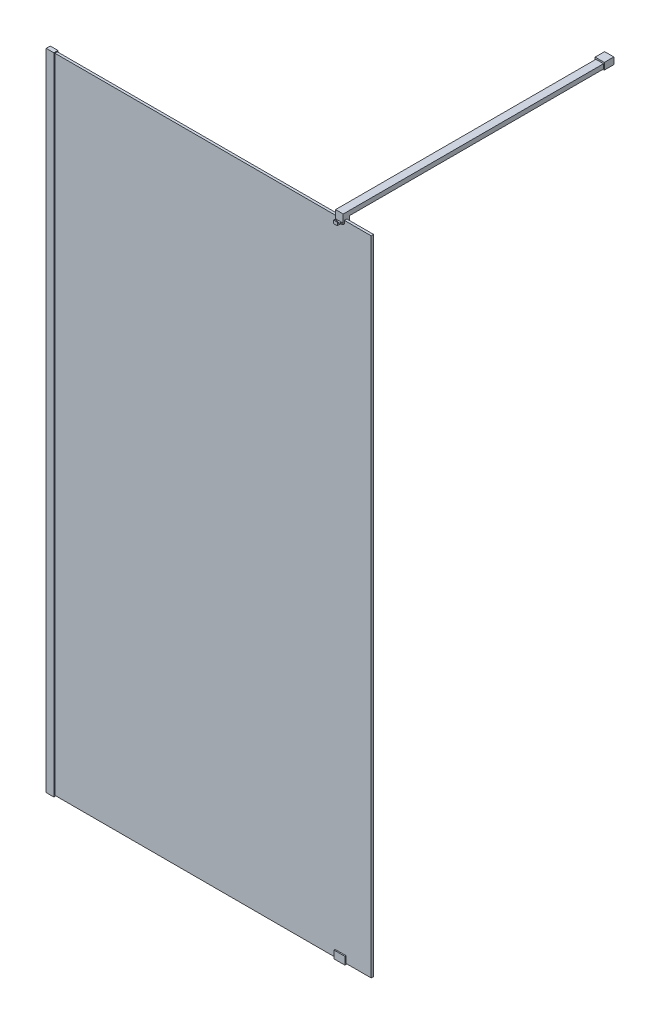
from build123d import *

# Parameters (mm, degrees)
DODANIE_WYCI_GNI_CIE1_DEPTH     = 2100
SZKIC2_W                        = 1047
SZKIC2_H                        = 8
DODANIE_WYCI_GNI_CIE2_DEPTH     = 2100
SZKIC4_W                        = 25
SZKIC4_H                        = 13.3
DODANIE_WYCI_GNI_CIE3_DEPTH     = 3
SZKIC5_W                        = 25
SZKIC5_H                        = 13.3
DODANIE_WYCI_GNI_CIE4_DEPTH     = 3
DODANIE_WYCI_GNI_CIE5_DEPTH     = 17.5
DODANIE_WYCI_GNI_CIE6_DEPTH     = 12.5
WYTNIJ_WYCI_GNI_CIE1_DEPTH      = 2355.421746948
WYTNIJ_WYCI_GNI_CIE1_DEPTH_BACK = 2355.421746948
SZKIC10_W                       = 25
SZKIC10_H                       = 861.63
DODANIE_WYCI_GNI_CIE7_DEPTH     = 15
SZKIC14_W                       = 30
SZKIC14_H                       = 22
DODANIE_WYCI_GNI_CIE8_DEPTH     = 31


with BuildPart() as part:
    # Szkic1 → Dodanie-wyci_gni_cie1 (new body)
    with BuildSketch(Plane(origin=(0, 0, 0), x_dir=(1, 0, 0), z_dir=(0, 1, 0))):
        Polygon((0, 0), (0, 13.3), (25, 13.3), (25, 11.4), (11.45, 11.4), (11.45, 3.4), (25, 3.4), (25, 0), align=None)
    extrude(amount=DODANIE_WYCI_GNI_CIE1_DEPTH)

    # Szkic4 → Dodanie-wyci_gni_cie3 (add)
    with BuildSketch(Plane(origin=(0, 2100, 0), x_dir=(1, 0, 0), z_dir=(0, 1, 0))):
        with Locations((12.5, 6.65)):
            Rectangle(SZKIC4_W, SZKIC4_H)
    extrude(amount=DODANIE_WYCI_GNI_CIE3_DEPTH)

    # Szkic5 → Dodanie-wyci_gni_cie4 (add)
    with BuildSketch(Plane.XZ):
        with Locations((12.5, -6.65)):
            Rectangle(SZKIC5_W, SZKIC5_H)
    extrude(amount=DODANIE_WYCI_GNI_CIE4_DEPTH)


with BuildPart() as body_2:
    # Szkic2 → Dodanie-wyci_gni_cie2 (new body)
    with BuildSketch(Plane.XZ):
        with Locations((534.95, -7.4)):
            Rectangle(SZKIC2_W, SZKIC2_H)
    extrude(amount=-DODANIE_WYCI_GNI_CIE2_DEPTH)


with BuildPart() as body_3:
    # Szkic6 → Dodanie-wyci_gni_cie5 (new, symmetric)
    with BuildSketch(Plane(origin=(958.45, 0, 0), x_dir=(0, 0, -1), z_dir=(1, 0, 0))):
        Polygon((11.4, 22), (15.75, 22), (15.75, -3), (-0.35, -3), (-0.35, 22), (3.4, 22), (3.4, 0), (11.4, 0), align=None)
    extrude(amount=DODANIE_WYCI_GNI_CIE5_DEPTH, both=True)


with BuildPart() as body_4:
    # Szkic7 → Dodanie-wyci_gni_cie6 (new, symmetric)
    with BuildSketch(Plane(origin=(958.45, 0, 0), x_dir=(0, 0, -1), z_dir=(1, 0, 0))):
        Polygon((-0.6, 2120), (19.4, 2120), (19.4, 2090), (11.4, 2090), (11.4, 2100), (3.4, 2100), (3.4, 2090), (-13.37, 2090), (-13.37, 2100), (-10.37, 2100), (-9.845068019, 2094), (-0.6, 2094), align=None)
    extrude(amount=DODANIE_WYCI_GNI_CIE6_DEPTH, both=True)

    # Szkic8 → Wytnij-wyci_gni_cie1 (cut, two sides: drawn at the far end of the back side and taken through both)
    with BuildSketch(Plane(origin=(0, 2100, 0), x_dir=(1, 0, 0), z_dir=(0, 1, 0)).offset(-WYTNIJ_WYCI_GNI_CIE1_DEPTH_BACK)):
        Polygon((-823.445499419, 824.482671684), (945.95, -0.6), (952.45, -3.630999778), (952.45, -13.37), (964.45, -13.37), (964.45, -3.630999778), (970.95, -0.6), (2740.345499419, 824.482671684), (2740.345499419, -3080.141176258), (-823.445499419, -3080.141176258), align=None)
    extrude(amount=WYTNIJ_WYCI_GNI_CIE1_DEPTH + WYTNIJ_WYCI_GNI_CIE1_DEPTH_BACK, mode=Mode.SUBTRACT)

    # Szkic10 → Dodanie-wyci_gni_cie7 (add)
    with BuildSketch(Plane(origin=(0, 2120, 0), x_dir=(1, 0, 0), z_dir=(0, 1, 0))):
        with Locations((958.45, 450.215)):
            Rectangle(SZKIC10_W, SZKIC10_H)
    extrude(amount=-DODANIE_WYCI_GNI_CIE7_DEPTH)

    # Szkic14 → Dodanie-wyci_gni_cie8 (add)
    with BuildSketch(Plane(origin=(0, 0, -881.03), x_dir=(-1, 0, 0), z_dir=(0, 0, -1))):
        with Locations((-958.45, 2114)):
            Rectangle(SZKIC14_W, SZKIC14_H)
    extrude(amount=-DODANIE_WYCI_GNI_CIE8_DEPTH)


solid = Compound([part.part, body_2.part, body_3.part, body_4.part])
